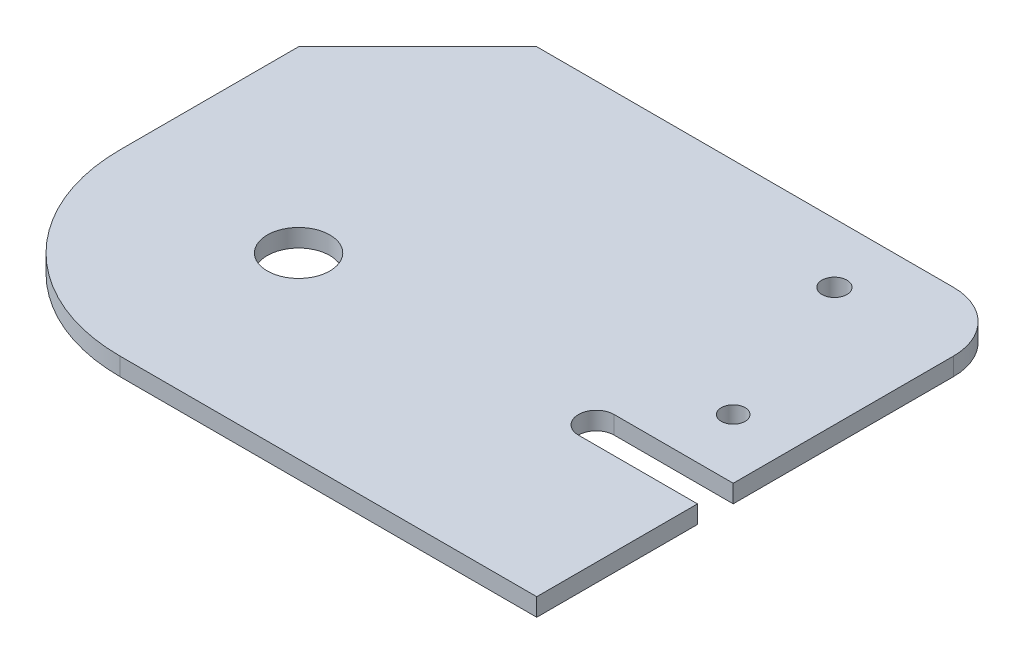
from build123d import *

# Parameters (mm, degrees)
SKETCH1_R         = 5.25
SKETCH1_R_2       = 2
EXTRUDE1_DEPTH    = 3
M5_TAPPED_HOLE1_D = 4.2


with BuildPart() as part:
    # Sketch1 → Extrude1 (new body)
    with BuildSketch(Plane(origin=(0, 0, 0), x_dir=(1, 0, 0), z_dir=(0, 1, 0))):
        with BuildLine():
            Line((20, 80), (0, 60))
            Line((0, 60), (0, 30))
            ThreePointArc((0, 30), (8.786796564, 8.786796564), (30, 0))
            Line((30, 0), (100, 0))
            Line((100, 0), (100, 27))
            Line((100, 27), (80, 27))
            ThreePointArc((80, 27), (77, 30), (80, 33))
            Line((80, 33), (100, 33))
            Line((100, 33), (100, 70))
            ThreePointArc((100, 70), (97.071067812, 77.071067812), (90, 80))
            Line((90, 80), (20, 80))
        make_face()
        with Locations(Location((30, 30, 0), (0, 0, 270))):
            Circle(SKETCH1_R, mode=Mode.SUBTRACT)
        with Locations(Location((90, 43, 0), (0, 0, 270))):
            Circle(SKETCH1_R_2, mode=Mode.SUBTRACT)
    extrude(amount=EXTRUDE1_DEPTH)

    # M5 Tapped Hole1 (through all)
    with Locations(Plane(origin=(80, 3, -70), x_dir=(0, 0, 1), z_dir=(0, 1, 0))):
        with Locations((0, 0)):
            Hole(M5_TAPPED_HOLE1_D / 2)


solid = part.part
